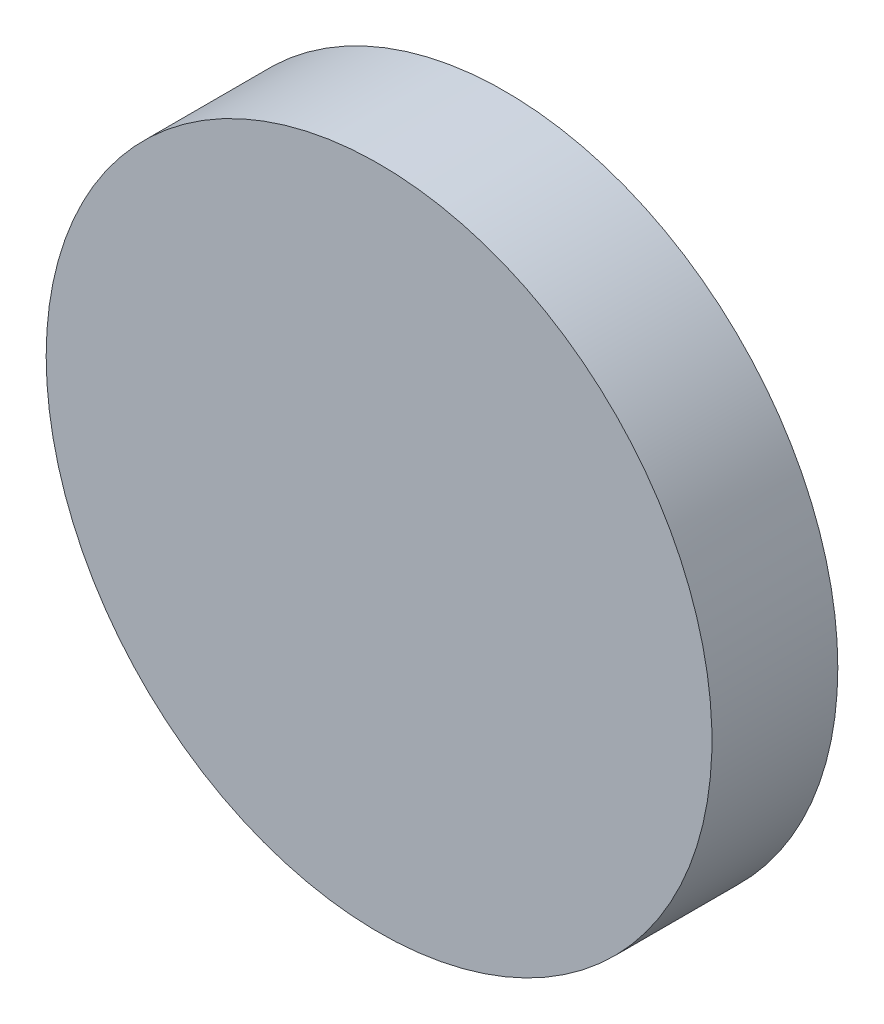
ISO-10303-21;
HEADER;
FILE_DESCRIPTION(('STEP AP214'),'2;1');
FILE_NAME('part.step','',(''),(''),'','','');
FILE_SCHEMA(('AUTOMOTIVE_DESIGN { 1 0 10303 214 1 1 1 1 }'));
ENDSEC;
DATA;
#1=APPLICATION_CONTEXT('core data for automotive mechanical design processes');
#2=APPLICATION_PROTOCOL_DEFINITION('international standard','automotive_design',2000,#1);
#3=PRODUCT_CONTEXT('',#1,'mechanical');
#4=PRODUCT('Part','Part','',(#3));
#5=PRODUCT_RELATED_PRODUCT_CATEGORY('part','',(#4));
#6=PRODUCT_DEFINITION_FORMATION('','',#4);
#7=PRODUCT_DEFINITION_CONTEXT('part definition',#1,'design');
#8=PRODUCT_DEFINITION('design','',#6,#7);
#9=PRODUCT_DEFINITION_SHAPE('','',#8);
#10=(LENGTH_UNIT() NAMED_UNIT(*) SI_UNIT(.MILLI.,.METRE.));
#11=(NAMED_UNIT(*) PLANE_ANGLE_UNIT() SI_UNIT($,.RADIAN.));
#12=(NAMED_UNIT(*) SI_UNIT($,.STERADIAN.) SOLID_ANGLE_UNIT());
#13=UNCERTAINTY_MEASURE_WITH_UNIT(LENGTH_MEASURE(1.E-05),#10,'distance_accuracy_value','');
#14=(GEOMETRIC_REPRESENTATION_CONTEXT(3) GLOBAL_UNCERTAINTY_ASSIGNED_CONTEXT((#13)) GLOBAL_UNIT_ASSIGNED_CONTEXT((#10,
#11,#12)) REPRESENTATION_CONTEXT('',''));
#15=CARTESIAN_POINT('',(0.,0.,0.));
#16=DIRECTION('',(0.,0.,1.));
#17=DIRECTION('',(1.,0.,0.));
#18=AXIS2_PLACEMENT_3D('',#15,#16,#17);
#19=CARTESIAN_POINT('',(-27.1371781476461,33.7022967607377,12.));
#20=DIRECTION('',(0.,0.,-1.));
#21=DIRECTION('',(-1.,0.,0.));
#22=AXIS2_PLACEMENT_3D('',#19,#20,#21);
#23=PLANE('',#22);
#24=CARTESIAN_POINT('',(-27.1371781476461,33.7022967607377,12.));
#25=DIRECTION('',(0.,0.,1.));
#26=DIRECTION('',(0.262310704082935,0.964983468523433,0.));
#27=AXIS2_PLACEMENT_3D('',#24,#25,#26);
#28=CIRCLE('',#27,4.00000000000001);
#29=CARTESIAN_POINT('',(-31.0130246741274,34.6911413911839,12.));
#30=VERTEX_POINT('',#29);
#31=CARTESIAN_POINT('',(-26.0879353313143,37.5622306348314,12.));
#32=VERTEX_POINT('',#31);
#33=EDGE_CURVE('E151',#30,#32,#28,.F.);
#34=ORIENTED_EDGE('',*,*,#33,.T.);
#35=CARTESIAN_POINT('',(-22.6778961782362,50.1070157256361,12.));
#36=DIRECTION('',(0.,0.,-1.));
#37=DIRECTION('',(0.412325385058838,-0.91103664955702,0.));
#38=AXIS2_PLACEMENT_3D('',#35,#36,#37);
#39=CIRCLE('',#38,13.);
#40=CARTESIAN_POINT('',(-17.3176661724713,38.2635392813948,12.));
#41=VERTEX_POINT('',#40);
#42=EDGE_CURVE('E143',#32,#41,#39,.F.);
#43=ORIENTED_EDGE('',*,*,#42,.T.);
#44=CARTESIAN_POINT('',(0.,0.,12.));
#45=DIRECTION('',(0.,0.,1.));
#46=DIRECTION('',(-0.999451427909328,-0.0331186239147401,0.));
#47=AXIS2_PLACEMENT_3D('',#44,#45,#46);
#48=CIRCLE('',#47,42.);
#49=CARTESIAN_POINT('',(-41.9769599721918,-1.39098220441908,12.));
#50=VERTEX_POINT('',#49);
#51=EDGE_CURVE('E147',#41,#50,#48,.F.);
#52=ORIENTED_EDGE('',*,*,#51,.T.);
#53=CARTESIAN_POINT('',(-54.969828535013,-1.8215243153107,12.));
#54=DIRECTION('',(0.,0.,-1.));
#55=DIRECTION('',(0.941403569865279,0.337282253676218,0.));
#56=AXIS2_PLACEMENT_3D('',#53,#54,#55);
#57=CIRCLE('',#56,13.);
#58=CARTESIAN_POINT('',(-42.7315821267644,2.56314498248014,12.));
#59=VERTEX_POINT('',#58);
#60=EDGE_CURVE('E212',#50,#59,#57,.F.);
#61=ORIENTED_EDGE('',*,*,#60,.T.);
#62=DIRECTION('',(-0.337282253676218,0.941403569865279,0.));
#63=VECTOR('',#62,1.);
#64=CARTESIAN_POINT('',(-44.1545751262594,6.53492433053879,12.));
#65=LINE('',#64,#63);
#66=CARTESIAN_POINT('',(-44.1545751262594,6.53492433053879,12.));
#67=VERTEX_POINT('',#66);
#68=EDGE_CURVE('E359',#59,#67,#65,.T.);
#69=ORIENTED_EDGE('',*,*,#68,.T.);
#70=CARTESIAN_POINT('',(-37.5647501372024,8.89590010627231,12.));
#71=DIRECTION('',(0.,0.,1.));
#72=DIRECTION('',(-1.,0.,0.));
#73=AXIS2_PLACEMENT_3D('',#70,#71,#72);
#74=CIRCLE('',#73,7.);
#75=CARTESIAN_POINT('',(-44.5647501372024,8.89590010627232,12.));
#76=VERTEX_POINT('',#75);
#77=EDGE_CURVE('E224',#67,#76,#74,.F.);
#78=ORIENTED_EDGE('',*,*,#77,.T.);
#79=CARTESIAN_POINT('',(-37.5647501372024,8.89590010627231,12.));
#80=DIRECTION('',(0.,0.,1.));
#81=DIRECTION('',(-0.992483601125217,0.122377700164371,0.));
#82=AXIS2_PLACEMENT_3D('',#79,#80,#81);
#83=CIRCLE('',#82,7.);
#84=CARTESIAN_POINT('',(-44.5121353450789,9.75254400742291,12.));
#85=VERTEX_POINT('',#84);
#86=EDGE_CURVE('E235',#76,#85,#83,.F.);
#87=ORIENTED_EDGE('',*,*,#86,.T.);
#88=CARTESIAN_POINT('',(-10.7676929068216,5.59170220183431,12.));
#89=DIRECTION('',(0.,0.,1.));
#90=DIRECTION('',(-0.659221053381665,0.75194920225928,0.));
#91=AXIS2_PLACEMENT_3D('',#88,#89,#90);
#92=CIRCLE('',#91,34.);
#93=CARTESIAN_POINT('',(-33.1812087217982,31.1579750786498,12.));
#94=VERTEX_POINT('',#93);
#95=EDGE_CURVE('E247',#85,#94,#92,.F.);
#96=ORIENTED_EDGE('',*,*,#95,.T.);
#97=CARTESIAN_POINT('',(-37.7957560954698,36.4216194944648,12.));
#98=DIRECTION('',(0.,0.,-1.));
#99=DIRECTION('',(0.968961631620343,-0.247211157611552,0.));
#100=AXIS2_PLACEMENT_3D('',#97,#98,#99);
#101=CIRCLE('',#100,7.);
#102=EDGE_CURVE('E259',#94,#30,#101,.F.);
#103=ORIENTED_EDGE('',*,*,#102,.T.);
#104=EDGE_LOOP('',(#34,#43,#52,#61,#69,#78,#87,#96,#103));
#105=FACE_BOUND('',#104,.T.);
#106=ADVANCED_FACE('F16',(#105),#23,.T.);
#107=CARTESIAN_POINT('',(-22.6778961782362,50.1070157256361,9.));
#108=DIRECTION('',(0.,0.,-1.));
#109=DIRECTION('',(-1.,0.,0.));
#110=AXIS2_PLACEMENT_3D('',#107,#108,#109);
#111=TOROIDAL_SURFACE('',#110,13.,3.);
#112=CARTESIAN_POINT('',(-22.6778961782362,50.1070157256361,9.));
#113=DIRECTION('',(0.,0.,-1.));
#114=DIRECTION('',(-1.,0.,0.));
#115=AXIS2_PLACEMENT_3D('',#112,#113,#114);
#116=CIRCLE('',#115,10.);
#117=CARTESIAN_POINT('',(-18.5546423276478,40.9966492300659,9.));
#118=VERTEX_POINT('',#117);
#119=CARTESIAN_POINT('',(-25.3010032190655,40.4571810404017,9.));
#120=VERTEX_POINT('',#119);
#121=EDGE_CURVE('E161',#118,#120,#116,.T.);
#122=ORIENTED_EDGE('',*,*,#121,.F.);
#123=CARTESIAN_POINT('',(-17.3176661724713,38.2635392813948,9.));
#124=DIRECTION('',(0.911036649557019,0.41232538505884,0.));
#125=DIRECTION('',(-0.41232538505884,0.911036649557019,0.));
#126=AXIS2_PLACEMENT_3D('',#123,#124,#125);
#127=CIRCLE('',#126,3.);
#128=EDGE_CURVE('E159',#118,#41,#127,.T.);
#129=ORIENTED_EDGE('',*,*,#128,.T.);
#130=ORIENTED_EDGE('',*,*,#42,.F.);
#131=CARTESIAN_POINT('',(-26.0879353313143,37.5622306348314,9.));
#132=DIRECTION('',(0.964983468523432,-0.262310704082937,0.));
#133=DIRECTION('',(0.262310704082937,0.964983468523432,0.));
#134=AXIS2_PLACEMENT_3D('',#131,#132,#133);
#135=CIRCLE('',#134,3.);
#136=EDGE_CURVE('E288',#32,#120,#135,.F.);
#137=ORIENTED_EDGE('',*,*,#136,.T.);
#138=EDGE_LOOP('',(#122,#129,#130,#137));
#139=FACE_BOUND('',#138,.T.);
#140=ADVANCED_FACE('F160',(#139),#111,.F.);
#141=CARTESIAN_POINT('',(0.,0.,9.));
#142=DIRECTION('',(0.,0.,-1.));
#143=DIRECTION('',(-1.,0.,0.));
#144=AXIS2_PLACEMENT_3D('',#141,#142,#143);
#145=TOROIDAL_SURFACE('',#144,42.,3.);
#146=CARTESIAN_POINT('',(0.,0.,9.));
#147=DIRECTION('',(0.,0.,-1.));
#148=DIRECTION('',(-1.,0.,0.));
#149=AXIS2_PLACEMENT_3D('',#146,#147,#148);
#150=CIRCLE('',#149,45.);
#151=CARTESIAN_POINT('',(-44.9753142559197,-1.4903380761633,9.));
#152=VERTEX_POINT('',#151);
#153=EDGE_CURVE('E376',#118,#152,#150,.T.);
#154=ORIENTED_EDGE('',*,*,#153,.T.);
#155=CARTESIAN_POINT('',(-41.9769599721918,-1.39098220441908,9.));
#156=DIRECTION('',(0.0331186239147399,-0.999451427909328,0.));
#157=DIRECTION('',(0.999451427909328,0.0331186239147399,0.));
#158=AXIS2_PLACEMENT_3D('',#155,#156,#157);
#159=CIRCLE('',#158,3.);
#160=EDGE_CURVE('E165',#152,#50,#159,.F.);
#161=ORIENTED_EDGE('',*,*,#160,.T.);
#162=ORIENTED_EDGE('',*,*,#51,.F.);
#163=ORIENTED_EDGE('',*,*,#128,.F.);
#164=EDGE_LOOP('',(#154,#161,#162,#163));
#165=FACE_BOUND('',#164,.T.);
#166=ADVANCED_FACE('F168',(#165),#145,.F.);
#167=CARTESIAN_POINT('',(-54.969828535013,-1.8215243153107,9.));
#168=DIRECTION('',(0.,0.,-1.));
#169=DIRECTION('',(-1.,0.,0.));
#170=AXIS2_PLACEMENT_3D('',#167,#168,#169);
#171=TOROIDAL_SURFACE('',#170,13.,3.);
#172=ORIENTED_EDGE('',*,*,#60,.F.);
#173=ORIENTED_EDGE('',*,*,#160,.F.);
#174=CARTESIAN_POINT('',(-54.969828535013,-1.8215243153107,9.));
#175=DIRECTION('',(0.,0.,-1.));
#176=DIRECTION('',(-1.,0.,0.));
#177=AXIS2_PLACEMENT_3D('',#174,#175,#176);
#178=CIRCLE('',#177,9.99999999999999);
#179=CARTESIAN_POINT('',(-45.5557928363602,1.55129822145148,9.));
#180=VERTEX_POINT('',#179);
#181=EDGE_CURVE('E378',#180,#152,#178,.T.);
#182=ORIENTED_EDGE('',*,*,#181,.F.);
#183=CARTESIAN_POINT('',(-42.7315821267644,2.56314498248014,9.));
#184=DIRECTION('',(-0.337282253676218,0.941403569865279,0.));
#185=DIRECTION('',(-0.941403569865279,-0.337282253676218,0.));
#186=AXIS2_PLACEMENT_3D('',#183,#184,#185);
#187=CIRCLE('',#186,3.);
#188=EDGE_CURVE('E367',#180,#59,#187,.T.);
#189=ORIENTED_EDGE('',*,*,#188,.T.);
#190=EDGE_LOOP('',(#172,#173,#182,#189));
#191=FACE_BOUND('',#190,.T.);
#192=ADVANCED_FACE('F189',(#191),#171,.F.);
#193=CARTESIAN_POINT('',(-44.1545751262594,6.53492433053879,9.));
#194=DIRECTION('',(-0.337282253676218,0.941403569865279,0.));
#195=DIRECTION('',(-0.941403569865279,-0.337282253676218,0.));
#196=AXIS2_PLACEMENT_3D('',#193,#194,#195);
#197=CYLINDRICAL_SURFACE('',#196,3.);
#198=ORIENTED_EDGE('',*,*,#68,.F.);
#199=ORIENTED_EDGE('',*,*,#188,.F.);
#200=DIRECTION('',(-0.337282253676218,0.941403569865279,0.));
#201=VECTOR('',#200,1.);
#202=CARTESIAN_POINT('',(-46.9787858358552,5.52307756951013,9.));
#203=LINE('',#202,#201);
#204=CARTESIAN_POINT('',(-46.9787858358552,5.52307756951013,9.));
#205=VERTEX_POINT('',#204);
#206=EDGE_CURVE('E385',#205,#180,#203,.F.);
#207=ORIENTED_EDGE('',*,*,#206,.F.);
#208=CARTESIAN_POINT('',(-44.1545751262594,6.53492433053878,9.));
#209=DIRECTION('',(-0.337282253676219,0.941403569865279,0.));
#210=DIRECTION('',(-0.941403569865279,-0.337282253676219,0.));
#211=AXIS2_PLACEMENT_3D('',#208,#209,#210);
#212=CIRCLE('',#211,3.);
#213=EDGE_CURVE('E366',#205,#67,#212,.T.);
#214=ORIENTED_EDGE('',*,*,#213,.T.);
#215=EDGE_LOOP('',(#198,#199,#207,#214));
#216=FACE_BOUND('',#215,.T.);
#217=ADVANCED_FACE('F481',(#216),#197,.F.);
#218=CARTESIAN_POINT('',(-37.5647501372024,8.89590010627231,9.));
#219=DIRECTION('',(0.,0.,-1.));
#220=DIRECTION('',(-1.,0.,0.));
#221=AXIS2_PLACEMENT_3D('',#218,#219,#220);
#222=TOROIDAL_SURFACE('',#221,7.,3.);
#223=ORIENTED_EDGE('',*,*,#86,.F.);
#224=ORIENTED_EDGE('',*,*,#77,.F.);
#225=ORIENTED_EDGE('',*,*,#213,.F.);
#226=CARTESIAN_POINT('',(-37.5647501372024,8.89590010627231,9.));
#227=DIRECTION('',(0.,0.,-1.));
#228=DIRECTION('',(-1.,0.,0.));
#229=AXIS2_PLACEMENT_3D('',#226,#227,#228);
#230=CIRCLE('',#229,10.);
#231=CARTESIAN_POINT('',(-47.4895861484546,10.119677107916,9.));
#232=VERTEX_POINT('',#231);
#233=EDGE_CURVE('E394',#205,#232,#230,.T.);
#234=ORIENTED_EDGE('',*,*,#233,.T.);
#235=CARTESIAN_POINT('',(-44.512135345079,9.75254400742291,9.));
#236=DIRECTION('',(0.122377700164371,0.992483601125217,0.));
#237=DIRECTION('',(-0.992483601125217,0.122377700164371,0.));
#238=AXIS2_PLACEMENT_3D('',#235,#236,#237);
#239=CIRCLE('',#238,3.);
#240=EDGE_CURVE('E335',#232,#85,#239,.T.);
#241=ORIENTED_EDGE('',*,*,#240,.T.);
#242=EDGE_LOOP('',(#223,#224,#225,#234,#241));
#243=FACE_BOUND('',#242,.T.);
#244=ADVANCED_FACE('F340',(#243),#222,.F.);
#245=CARTESIAN_POINT('',(-10.7676929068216,5.59170220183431,9.));
#246=DIRECTION('',(0.,0.,-1.));
#247=DIRECTION('',(-1.,0.,0.));
#248=AXIS2_PLACEMENT_3D('',#245,#246,#247);
#249=TOROIDAL_SURFACE('',#248,34.,3.);
#250=ORIENTED_EDGE('',*,*,#95,.F.);
#251=ORIENTED_EDGE('',*,*,#240,.F.);
#252=CARTESIAN_POINT('',(-10.7676929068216,5.59170220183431,9.));
#253=DIRECTION('',(0.,0.,-1.));
#254=DIRECTION('',(-1.,0.,0.));
#255=AXIS2_PLACEMENT_3D('',#252,#253,#254);
#256=CIRCLE('',#255,37.);
#257=CARTESIAN_POINT('',(-35.1588718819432,33.4138226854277,9.));
#258=VERTEX_POINT('',#257);
#259=EDGE_CURVE('E326',#232,#258,#256,.T.);
#260=ORIENTED_EDGE('',*,*,#259,.T.);
#261=CARTESIAN_POINT('',(-33.1812087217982,31.1579750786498,9.));
#262=DIRECTION('',(-0.75194920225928,-0.659221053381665,0.));
#263=DIRECTION('',(0.659221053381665,-0.75194920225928,0.));
#264=AXIS2_PLACEMENT_3D('',#261,#262,#263);
#265=CIRCLE('',#264,3.);
#266=EDGE_CURVE('E278',#258,#94,#265,.F.);
#267=ORIENTED_EDGE('',*,*,#266,.T.);
#268=EDGE_LOOP('',(#250,#251,#260,#267));
#269=FACE_BOUND('',#268,.T.);
#270=ADVANCED_FACE('F337',(#269),#249,.F.);
#271=CARTESIAN_POINT('',(-37.7957560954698,36.4216194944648,9.));
#272=DIRECTION('',(0.,0.,-1.));
#273=DIRECTION('',(-1.,0.,0.));
#274=AXIS2_PLACEMENT_3D('',#271,#272,#273);
#275=TOROIDAL_SURFACE('',#274,7.,3.);
#276=ORIENTED_EDGE('',*,*,#102,.F.);
#277=ORIENTED_EDGE('',*,*,#266,.F.);
#278=CARTESIAN_POINT('',(-37.7957560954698,36.4216194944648,9.));
#279=DIRECTION('',(0.,0.,-1.));
#280=DIRECTION('',(-1.,0.,0.));
#281=AXIS2_PLACEMENT_3D('',#278,#279,#280);
#282=CIRCLE('',#281,4.);
#283=CARTESIAN_POINT('',(-33.9199095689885,35.4327748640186,9.));
#284=VERTEX_POINT('',#283);
#285=EDGE_CURVE('E283',#284,#258,#282,.T.);
#286=ORIENTED_EDGE('',*,*,#285,.F.);
#287=CARTESIAN_POINT('',(-31.0130246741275,34.6911413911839,9.));
#288=DIRECTION('',(0.247211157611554,0.968961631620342,0.));
#289=DIRECTION('',(-0.968961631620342,0.247211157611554,0.));
#290=AXIS2_PLACEMENT_3D('',#287,#288,#289);
#291=CIRCLE('',#290,3.);
#292=EDGE_CURVE('E280',#284,#30,#291,.T.);
#293=ORIENTED_EDGE('',*,*,#292,.T.);
#294=EDGE_LOOP('',(#276,#277,#286,#293));
#295=FACE_BOUND('',#294,.T.);
#296=ADVANCED_FACE('F281',(#295),#275,.F.);
#297=CARTESIAN_POINT('',(-27.1371781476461,33.7022967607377,9.));
#298=DIRECTION('',(0.,0.,-1.));
#299=DIRECTION('',(-1.,0.,0.));
#300=AXIS2_PLACEMENT_3D('',#297,#298,#299);
#301=TOROIDAL_SURFACE('',#300,4.00000000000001,3.);
#302=CARTESIAN_POINT('',(-27.1371781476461,33.7022967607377,9.));
#303=DIRECTION('',(0.,0.,-1.));
#304=DIRECTION('',(-1.,0.,0.));
#305=AXIS2_PLACEMENT_3D('',#302,#303,#304);
#306=CIRCLE('',#305,7.00000000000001);
#307=EDGE_CURVE('E317',#284,#120,#306,.T.);
#308=ORIENTED_EDGE('',*,*,#307,.T.);
#309=ORIENTED_EDGE('',*,*,#136,.F.);
#310=ORIENTED_EDGE('',*,*,#33,.F.);
#311=ORIENTED_EDGE('',*,*,#292,.F.);
#312=EDGE_LOOP('',(#308,#309,#310,#311));
#313=FACE_BOUND('',#312,.T.);
#314=ADVANCED_FACE('F291',(#313),#301,.F.);
#315=CARTESIAN_POINT('',(-22.6778961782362,50.1070157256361,12.));
#316=DIRECTION('',(0.,0.,-1.));
#317=DIRECTION('',(-1.,0.,0.));
#318=AXIS2_PLACEMENT_3D('',#315,#316,#317);
#319=CYLINDRICAL_SURFACE('',#318,10.);
#320=DIRECTION('',(0.,0.,-1.));
#321=VECTOR('',#320,1.);
#322=CARTESIAN_POINT('',(-25.3010032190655,40.4571810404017,12.));
#323=LINE('',#322,#321);
#324=CARTESIAN_POINT('',(-25.3010032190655,40.4571810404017,1.00000000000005));
#325=VERTEX_POINT('',#324);
#326=EDGE_CURVE('E72',#120,#325,#323,.T.);
#327=ORIENTED_EDGE('',*,*,#326,.T.);
#328=CARTESIAN_POINT('',(-22.6778961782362,50.1070157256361,1.00000000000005));
#329=DIRECTION('',(0.,0.,1.));
#330=DIRECTION('',(1.,0.,0.));
#331=AXIS2_PLACEMENT_3D('',#328,#329,#330);
#332=CIRCLE('',#331,10.);
#333=CARTESIAN_POINT('',(-18.5546423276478,40.9966492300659,1.00000000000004));
#334=VERTEX_POINT('',#333);
#335=EDGE_CURVE('E429',#334,#325,#332,.F.);
#336=ORIENTED_EDGE('',*,*,#335,.F.);
#337=DIRECTION('',(0.,0.,-1.));
#338=VECTOR('',#337,1.);
#339=CARTESIAN_POINT('',(-18.5546423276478,40.9966492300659,12.));
#340=LINE('',#339,#338);
#341=EDGE_CURVE('E379',#334,#118,#340,.F.);
#342=ORIENTED_EDGE('',*,*,#341,.T.);
#343=ORIENTED_EDGE('',*,*,#121,.T.);
#344=EDGE_LOOP('',(#327,#336,#342,#343));
#345=FACE_BOUND('',#344,.T.);
#346=ADVANCED_FACE('F309',(#345),#319,.T.);
#347=CARTESIAN_POINT('',(0.,0.,12.));
#348=DIRECTION('',(0.,0.,-1.));
#349=DIRECTION('',(-1.,0.,0.));
#350=AXIS2_PLACEMENT_3D('',#347,#348,#349);
#351=CYLINDRICAL_SURFACE('',#350,45.);
#352=ORIENTED_EDGE('',*,*,#153,.F.);
#353=ORIENTED_EDGE('',*,*,#341,.F.);
#354=CARTESIAN_POINT('',(0.,0.,1.00000000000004));
#355=DIRECTION('',(0.,0.,-1.));
#356=DIRECTION('',(-1.,0.,0.));
#357=AXIS2_PLACEMENT_3D('',#354,#355,#356);
#358=CIRCLE('',#357,45.);
#359=CARTESIAN_POINT('',(-44.9753142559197,-1.4903380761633,1.00000000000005));
#360=VERTEX_POINT('',#359);
#361=EDGE_CURVE('E418',#334,#360,#358,.T.);
#362=ORIENTED_EDGE('',*,*,#361,.T.);
#363=DIRECTION('',(0.,0.,-1.));
#364=VECTOR('',#363,1.);
#365=CARTESIAN_POINT('',(-44.9753142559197,-1.4903380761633,12.));
#366=LINE('',#365,#364);
#367=EDGE_CURVE('E384',#152,#360,#366,.T.);
#368=ORIENTED_EDGE('',*,*,#367,.F.);
#369=EDGE_LOOP('',(#352,#353,#362,#368));
#370=FACE_BOUND('',#369,.T.);
#371=ADVANCED_FACE('F468',(#370),#351,.F.);
#372=CARTESIAN_POINT('',(-54.969828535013,-1.8215243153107,12.));
#373=DIRECTION('',(0.,0.,-1.));
#374=DIRECTION('',(-1.,0.,0.));
#375=AXIS2_PLACEMENT_3D('',#372,#373,#374);
#376=CYLINDRICAL_SURFACE('',#375,9.99999999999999);
#377=ORIENTED_EDGE('',*,*,#367,.T.);
#378=CARTESIAN_POINT('',(-54.969828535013,-1.8215243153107,1.00000000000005));
#379=DIRECTION('',(0.,0.,1.));
#380=DIRECTION('',(1.,0.,0.));
#381=AXIS2_PLACEMENT_3D('',#378,#379,#380);
#382=CIRCLE('',#381,10.);
#383=CARTESIAN_POINT('',(-45.5557928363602,1.55129822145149,1.00000000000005));
#384=VERTEX_POINT('',#383);
#385=EDGE_CURVE('E414',#384,#360,#382,.F.);
#386=ORIENTED_EDGE('',*,*,#385,.F.);
#387=DIRECTION('',(0.,0.,1.));
#388=VECTOR('',#387,1.);
#389=CARTESIAN_POINT('',(-45.5557928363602,1.55129822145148,12.));
#390=LINE('',#389,#388);
#391=EDGE_CURVE('E388',#180,#384,#390,.F.);
#392=ORIENTED_EDGE('',*,*,#391,.F.);
#393=ORIENTED_EDGE('',*,*,#181,.T.);
#394=EDGE_LOOP('',(#377,#386,#392,#393));
#395=FACE_BOUND('',#394,.T.);
#396=ADVANCED_FACE('F478',(#395),#376,.T.);
#397=CARTESIAN_POINT('',(-46.9787858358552,5.52307756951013,12.));
#398=DIRECTION('',(0.941403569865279,0.337282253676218,0.));
#399=DIRECTION('',(-0.337282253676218,0.941403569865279,0.));
#400=AXIS2_PLACEMENT_3D('',#397,#398,#399);
#401=PLANE('',#400);
#402=ORIENTED_EDGE('',*,*,#391,.T.);
#403=DIRECTION('',(0.337282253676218,-0.941403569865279,0.));
#404=VECTOR('',#403,1.);
#405=CARTESIAN_POINT('',(-46.9787858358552,5.52307756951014,1.00000000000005));
#406=LINE('',#405,#404);
#407=CARTESIAN_POINT('',(-46.9787858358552,5.52307756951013,1.00000000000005));
#408=VERTEX_POINT('',#407);
#409=EDGE_CURVE('E409',#408,#384,#406,.T.);
#410=ORIENTED_EDGE('',*,*,#409,.F.);
#411=DIRECTION('',(0.,0.,-1.));
#412=VECTOR('',#411,1.);
#413=CARTESIAN_POINT('',(-46.9787858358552,5.52307756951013,12.));
#414=LINE('',#413,#412);
#415=EDGE_CURVE('E395',#408,#205,#414,.F.);
#416=ORIENTED_EDGE('',*,*,#415,.T.);
#417=ORIENTED_EDGE('',*,*,#206,.T.);
#418=EDGE_LOOP('',(#402,#410,#416,#417));
#419=FACE_BOUND('',#418,.T.);
#420=ADVANCED_FACE('F537',(#419),#401,.T.);
#421=CARTESIAN_POINT('',(-37.5647501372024,8.89590010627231,12.));
#422=DIRECTION('',(0.,0.,-1.));
#423=DIRECTION('',(-1.,0.,0.));
#424=AXIS2_PLACEMENT_3D('',#421,#422,#423);
#425=CYLINDRICAL_SURFACE('',#424,10.);
#426=ORIENTED_EDGE('',*,*,#233,.F.);
#427=ORIENTED_EDGE('',*,*,#415,.F.);
#428=CARTESIAN_POINT('',(-37.5647501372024,8.89590010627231,1.00000000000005));
#429=DIRECTION('',(0.,0.,-1.));
#430=DIRECTION('',(-1.,0.,0.));
#431=AXIS2_PLACEMENT_3D('',#428,#429,#430);
#432=CIRCLE('',#431,10.);
#433=CARTESIAN_POINT('',(-47.4895861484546,10.119677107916,1.00000000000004));
#434=VERTEX_POINT('',#433);
#435=EDGE_CURVE('E443',#408,#434,#432,.T.);
#436=ORIENTED_EDGE('',*,*,#435,.T.);
#437=DIRECTION('',(0.,0.,-1.));
#438=VECTOR('',#437,1.);
#439=CARTESIAN_POINT('',(-47.4895861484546,10.119677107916,12.));
#440=LINE('',#439,#438);
#441=EDGE_CURVE('E327',#434,#232,#440,.F.);
#442=ORIENTED_EDGE('',*,*,#441,.T.);
#443=EDGE_LOOP('',(#426,#427,#436,#442));
#444=FACE_BOUND('',#443,.T.);
#445=ADVANCED_FACE('F539',(#444),#425,.F.);
#446=CARTESIAN_POINT('',(-10.7676929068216,5.59170220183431,12.));
#447=DIRECTION('',(0.,0.,-1.));
#448=DIRECTION('',(-1.,0.,0.));
#449=AXIS2_PLACEMENT_3D('',#446,#447,#448);
#450=CYLINDRICAL_SURFACE('',#449,37.);
#451=ORIENTED_EDGE('',*,*,#259,.F.);
#452=ORIENTED_EDGE('',*,*,#441,.F.);
#453=CARTESIAN_POINT('',(-10.7676929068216,5.59170220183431,1.00000000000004));
#454=DIRECTION('',(0.,0.,-1.));
#455=DIRECTION('',(-1.,0.,0.));
#456=AXIS2_PLACEMENT_3D('',#453,#454,#455);
#457=CIRCLE('',#456,37.);
#458=CARTESIAN_POINT('',(-35.1588718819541,33.4138226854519,1.00000000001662));
#459=VERTEX_POINT('',#458);
#460=EDGE_CURVE('E441',#434,#459,#457,.T.);
#461=ORIENTED_EDGE('',*,*,#460,.T.);
#462=DIRECTION('',(0.,0.,-1.));
#463=VECTOR('',#462,1.);
#464=CARTESIAN_POINT('',(-35.1588718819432,33.4138226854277,12.));
#465=LINE('',#464,#463);
#466=EDGE_CURVE('E325',#258,#459,#465,.T.);
#467=ORIENTED_EDGE('',*,*,#466,.F.);
#468=EDGE_LOOP('',(#451,#452,#461,#467));
#469=FACE_BOUND('',#468,.T.);
#470=ADVANCED_FACE('F529',(#469),#450,.F.);
#471=CARTESIAN_POINT('',(-37.7957560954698,36.4216194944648,12.));
#472=DIRECTION('',(0.,0.,-1.));
#473=DIRECTION('',(-1.,0.,0.));
#474=AXIS2_PLACEMENT_3D('',#471,#472,#473);
#475=CYLINDRICAL_SURFACE('',#474,4.);
#476=ORIENTED_EDGE('',*,*,#466,.T.);
#477=CARTESIAN_POINT('',(-37.7957560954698,36.4216194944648,1.0000000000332));
#478=DIRECTION('',(0.,0.,1.));
#479=DIRECTION('',(1.,0.,0.));
#480=AXIS2_PLACEMENT_3D('',#477,#478,#479);
#481=CIRCLE('',#480,3.99999999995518);
#482=CARTESIAN_POINT('',(-33.9199095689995,35.4327748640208,1.00000000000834));
#483=VERTEX_POINT('',#482);
#484=EDGE_CURVE('E436',#483,#459,#481,.F.);
#485=ORIENTED_EDGE('',*,*,#484,.F.);
#486=DIRECTION('',(0.,0.,-1.));
#487=VECTOR('',#486,1.);
#488=CARTESIAN_POINT('',(-33.9199095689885,35.4327748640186,12.));
#489=LINE('',#488,#487);
#490=EDGE_CURVE('E432',#483,#284,#489,.F.);
#491=ORIENTED_EDGE('',*,*,#490,.T.);
#492=ORIENTED_EDGE('',*,*,#285,.T.);
#493=EDGE_LOOP('',(#476,#485,#491,#492));
#494=FACE_BOUND('',#493,.T.);
#495=ADVANCED_FACE('F525',(#494),#475,.T.);
#496=CARTESIAN_POINT('',(-27.1371781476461,33.7022967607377,12.));
#497=DIRECTION('',(0.,0.,-1.));
#498=DIRECTION('',(-1.,0.,0.));
#499=AXIS2_PLACEMENT_3D('',#496,#497,#498);
#500=CYLINDRICAL_SURFACE('',#499,7.00000000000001);
#501=ORIENTED_EDGE('',*,*,#307,.F.);
#502=ORIENTED_EDGE('',*,*,#490,.F.);
#503=CARTESIAN_POINT('',(-27.1371781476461,33.7022967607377,1.00000000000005));
#504=DIRECTION('',(0.,0.,-1.));
#505=DIRECTION('',(-1.,0.,0.));
#506=AXIS2_PLACEMENT_3D('',#503,#504,#505);
#507=CIRCLE('',#506,7.00000000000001);
#508=EDGE_CURVE('E428',#483,#325,#507,.T.);
#509=ORIENTED_EDGE('',*,*,#508,.T.);
#510=ORIENTED_EDGE('',*,*,#326,.F.);
#511=EDGE_LOOP('',(#501,#502,#509,#510));
#512=FACE_BOUND('',#511,.T.);
#513=ADVANCED_FACE('F425',(#512),#500,.F.);
#514=CARTESIAN_POINT('',(-22.6778961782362,50.1070157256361,1.00000000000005));
#515=DIRECTION('',(0.,0.,1.));
#516=DIRECTION('',(1.,0.,0.));
#517=AXIS2_PLACEMENT_3D('',#514,#515,#516);
#518=CONICAL_SURFACE('',#517,10.,0.523598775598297);
#519=DIRECTION('',(-0.131155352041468,-0.482491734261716,0.866025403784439));
#520=VECTOR('',#519,1.);
#521=CARTESIAN_POINT('',(-25.1495580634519,41.0143145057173,0.));
#522=LINE('',#521,#520);
#523=CARTESIAN_POINT('',(-25.1495580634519,41.0143145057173,0.));
#524=VERTEX_POINT('',#523);
#525=EDGE_CURVE('E63',#325,#524,#522,.F.);
#526=ORIENTED_EDGE('',*,*,#525,.T.);
#527=CARTESIAN_POINT('',(-22.6778961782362,50.1070157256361,0.));
#528=DIRECTION('',(0.,0.,1.));
#529=DIRECTION('',(1.,0.,0.));
#530=AXIS2_PLACEMENT_3D('',#527,#528,#529);
#531=CIRCLE('',#530,9.42264973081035);
#532=CARTESIAN_POINT('',(-18.7926984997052,41.5226364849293,0.));
#533=VERTEX_POINT('',#532);
#534=EDGE_CURVE('E463',#524,#533,#531,.T.);
#535=ORIENTED_EDGE('',*,*,#534,.T.);
#536=DIRECTION('',(0.20616269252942,-0.455518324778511,0.866025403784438));
#537=VECTOR('',#536,1.);
#538=CARTESIAN_POINT('',(-18.7926984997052,41.5226364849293,0.));
#539=LINE('',#538,#537);
#540=EDGE_CURVE('E420',#533,#334,#539,.T.);
#541=ORIENTED_EDGE('',*,*,#540,.T.);
#542=ORIENTED_EDGE('',*,*,#335,.T.);
#543=EDGE_LOOP('',(#526,#535,#541,#542));
#544=FACE_BOUND('',#543,.T.);
#545=ADVANCED_FACE('F461',(#544),#518,.T.);
#546=CARTESIAN_POINT('',(0.,0.,0.));
#547=DIRECTION('',(0.,0.,-1.));
#548=DIRECTION('',(-1.,0.,0.));
#549=AXIS2_PLACEMENT_3D('',#546,#547,#548);
#550=CONICAL_SURFACE('',#549,45.5773502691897,0.523598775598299);
#551=ORIENTED_EDGE('',*,*,#361,.F.);
#552=ORIENTED_EDGE('',*,*,#540,.F.);
#553=CARTESIAN_POINT('',(0.,0.,0.));
#554=DIRECTION('',(0.,0.,-1.));
#555=DIRECTION('',(-1.,0.,0.));
#556=AXIS2_PLACEMENT_3D('',#553,#554,#555);
#557=CIRCLE('',#556,45.5773502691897);
#558=CARTESIAN_POINT('',(-45.5523478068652,-1.50945912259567,0.));
#559=VERTEX_POINT('',#558);
#560=EDGE_CURVE('E471',#533,#559,#557,.T.);
#561=ORIENTED_EDGE('',*,*,#560,.T.);
#562=DIRECTION('',(-0.499725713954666,-0.01655931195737,-0.866025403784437));
#563=VECTOR('',#562,1.);
#564=CARTESIAN_POINT('',(-45.5523478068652,-1.50945912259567,0.));
#565=LINE('',#564,#563);
#566=EDGE_CURVE('E417',#360,#559,#565,.T.);
#567=ORIENTED_EDGE('',*,*,#566,.F.);
#568=EDGE_LOOP('',(#551,#552,#561,#567));
#569=FACE_BOUND('',#568,.T.);
#570=ADVANCED_FACE('F470',(#569),#550,.F.);
#571=CARTESIAN_POINT('',(-54.969828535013,-1.8215243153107,1.00000000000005));
#572=DIRECTION('',(0.,0.,1.));
#573=DIRECTION('',(1.,0.,0.));
#574=AXIS2_PLACEMENT_3D('',#571,#572,#573);
#575=CONICAL_SURFACE('',#574,10.,0.523598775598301);
#576=ORIENTED_EDGE('',*,*,#566,.T.);
#577=CARTESIAN_POINT('',(-54.969828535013,-1.8215243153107,0.));
#578=DIRECTION('',(0.,0.,1.));
#579=DIRECTION('',(1.,0.,0.));
#580=AXIS2_PLACEMENT_3D('',#577,#578,#579);
#581=CIRCLE('',#580,9.42264973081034);
#582=CARTESIAN_POINT('',(-46.099312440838,1.35656822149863,0.));
#583=VERTEX_POINT('',#582);
#584=EDGE_CURVE('E485',#559,#583,#581,.T.);
#585=ORIENTED_EDGE('',*,*,#584,.T.);
#586=DIRECTION('',(-0.470701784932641,-0.168641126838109,-0.866025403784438));
#587=VECTOR('',#586,1.);
#588=CARTESIAN_POINT('',(-45.5557928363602,1.55129822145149,1.00000000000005));
#589=LINE('',#588,#587);
#590=EDGE_CURVE('E412',#384,#583,#589,.T.);
#591=ORIENTED_EDGE('',*,*,#590,.F.);
#592=ORIENTED_EDGE('',*,*,#385,.T.);
#593=EDGE_LOOP('',(#576,#585,#591,#592));
#594=FACE_BOUND('',#593,.T.);
#595=ADVANCED_FACE('F475',(#594),#575,.T.);
#596=CARTESIAN_POINT('',(-40.4243502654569,-14.4830722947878,0.));
#597=DIRECTION('',(0.81527940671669,0.292094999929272,-0.500000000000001));
#598=DIRECTION('',(-0.522799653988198,0.,-0.852455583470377));
#599=AXIS2_PLACEMENT_3D('',#596,#597,#598);
#600=PLANE('',#599);
#601=DIRECTION('',(0.470701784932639,0.168641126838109,0.866025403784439));
#602=VECTOR('',#601,1.);
#603=CARTESIAN_POINT('',(-47.522305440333,5.32834756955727,0.));
#604=LINE('',#603,#602);
#605=CARTESIAN_POINT('',(-47.522305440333,5.32834756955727,0.));
#606=VERTEX_POINT('',#605);
#607=EDGE_CURVE('E411',#606,#408,#604,.T.);
#608=ORIENTED_EDGE('',*,*,#607,.T.);
#609=ORIENTED_EDGE('',*,*,#409,.T.);
#610=ORIENTED_EDGE('',*,*,#590,.T.);
#611=DIRECTION('',(-0.337282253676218,0.941403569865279,0.));
#612=VECTOR('',#611,1.);
#613=CARTESIAN_POINT('',(-46.099312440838,1.35656822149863,0.));
#614=LINE('',#613,#612);
#615=EDGE_CURVE('E487',#583,#606,#614,.T.);
#616=ORIENTED_EDGE('',*,*,#615,.T.);
#617=EDGE_LOOP('',(#608,#609,#610,#616));
#618=FACE_BOUND('',#617,.T.);
#619=ADVANCED_FACE('F536',(#618),#600,.T.);
#620=CARTESIAN_POINT('',(-37.5647501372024,8.89590010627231,0.));
#621=DIRECTION('',(0.,0.,-1.));
#622=DIRECTION('',(-1.,0.,0.));
#623=AXIS2_PLACEMENT_3D('',#620,#621,#622);
#624=CONICAL_SURFACE('',#623,10.5773502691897,0.523598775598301);
#625=ORIENTED_EDGE('',*,*,#435,.F.);
#626=ORIENTED_EDGE('',*,*,#607,.F.);
#627=CARTESIAN_POINT('',(-37.5647501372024,8.89590010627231,0.));
#628=DIRECTION('',(0.,0.,-1.));
#629=DIRECTION('',(-1.,0.,0.));
#630=AXIS2_PLACEMENT_3D('',#627,#628,#629);
#631=CIRCLE('',#630,10.5773502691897);
#632=CARTESIAN_POINT('',(-48.0625968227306,10.1903319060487,0.));
#633=VERTEX_POINT('',#632);
#634=EDGE_CURVE('E488',#606,#633,#631,.T.);
#635=ORIENTED_EDGE('',*,*,#634,.T.);
#636=DIRECTION('',(0.49624180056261,-0.0611888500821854,0.866025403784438));
#637=VECTOR('',#636,1.);
#638=CARTESIAN_POINT('',(-48.0625968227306,10.1903319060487,0.));
#639=LINE('',#638,#637);
#640=EDGE_CURVE('E440',#633,#434,#639,.T.);
#641=ORIENTED_EDGE('',*,*,#640,.T.);
#642=EDGE_LOOP('',(#625,#626,#635,#641));
#643=FACE_BOUND('',#642,.T.);
#644=ADVANCED_FACE('F534',(#643),#624,.F.);
#645=CARTESIAN_POINT('',(-10.7676929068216,5.59170220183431,0.));
#646=DIRECTION('',(0.,0.,-1.));
#647=DIRECTION('',(-1.,0.,0.));
#648=AXIS2_PLACEMENT_3D('',#645,#646,#647);
#649=CONICAL_SURFACE('',#648,37.5773502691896,0.523598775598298);
#650=CARTESIAN_POINT('',(-10.7676929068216,5.59170220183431,0.));
#651=DIRECTION('',(0.,0.,-1.));
#652=DIRECTION('',(-1.,0.,0.));
#653=AXIS2_PLACEMENT_3D('',#650,#651,#652);
#654=CIRCLE('',#653,37.5773502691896);
#655=CARTESIAN_POINT('',(-35.5394733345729,33.8479607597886,5.44707955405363E-11));
#656=VERTEX_POINT('',#655);
#657=EDGE_CURVE('E490',#633,#656,#654,.T.);
#658=ORIENTED_EDGE('',*,*,#657,.T.);
#659=DIRECTION('',(-0.329610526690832,0.375974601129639,-0.866025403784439));
#660=VECTOR('',#659,1.);
#661=CARTESIAN_POINT('',(189884.585386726,-216601.051135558,499000.));
#662=LINE('',#661,#660);
#663=EDGE_CURVE('E439',#459,#656,#662,.T.);
#664=ORIENTED_EDGE('',*,*,#663,.F.);
#665=ORIENTED_EDGE('',*,*,#460,.F.);
#666=ORIENTED_EDGE('',*,*,#640,.F.);
#667=EDGE_LOOP('',(#658,#664,#665,#666));
#668=FACE_BOUND('',#667,.T.);
#669=ADVANCED_FACE('F532',(#668),#649,.F.);
#670=CARTESIAN_POINT('',(-37.7957560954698,36.4216194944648,1.0000000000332));
#671=DIRECTION('',(0.,0.,1.));
#672=DIRECTION('',(1.,0.,0.));
#673=AXIS2_PLACEMENT_3D('',#670,#671,#672);
#674=CONICAL_SURFACE('',#673,3.99999999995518,0.523598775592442);
#675=ORIENTED_EDGE('',*,*,#663,.T.);
#676=CARTESIAN_POINT('',(-37.7957560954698,36.4216194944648,5.6843418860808E-11));
#677=DIRECTION('',(0.,0.,1.));
#678=DIRECTION('',(1.,0.,0.));
#679=AXIS2_PLACEMENT_3D('',#676,#677,#678);
#680=CIRCLE('',#679,3.42264973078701);
#681=CARTESIAN_POINT('',(-34.479339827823,35.5755022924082,2.8419974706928E-11));
#682=VERTEX_POINT('',#681);
#683=EDGE_CURVE('E37',#656,#682,#680,.T.);
#684=ORIENTED_EDGE('',*,*,#683,.T.);
#685=DIRECTION('',(0.484480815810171,-0.123605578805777,0.866025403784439));
#686=VECTOR('',#685,1.);
#687=CARTESIAN_POINT('',(-34.4793398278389,35.5755022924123,0.));
#688=LINE('',#687,#686);
#689=EDGE_CURVE('E513',#682,#483,#688,.T.);
#690=ORIENTED_EDGE('',*,*,#689,.T.);
#691=ORIENTED_EDGE('',*,*,#484,.T.);
#692=EDGE_LOOP('',(#675,#684,#690,#691));
#693=FACE_BOUND('',#692,.T.);
#694=ADVANCED_FACE('F515',(#693),#674,.T.);
#695=CARTESIAN_POINT('',(-27.1371781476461,33.7022967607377,0.));
#696=DIRECTION('',(0.,0.,-1.));
#697=DIRECTION('',(-1.,0.,0.));
#698=AXIS2_PLACEMENT_3D('',#695,#696,#697);
#699=CONICAL_SURFACE('',#698,7.57735026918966,0.523598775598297);
#700=ORIENTED_EDGE('',*,*,#508,.F.);
#701=ORIENTED_EDGE('',*,*,#689,.F.);
#702=CARTESIAN_POINT('',(-27.1371781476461,33.7022967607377,0.));
#703=DIRECTION('',(0.,0.,-1.));
#704=DIRECTION('',(-1.,0.,0.));
#705=AXIS2_PLACEMENT_3D('',#702,#703,#704);
#706=CIRCLE('',#705,7.57735026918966);
#707=EDGE_CURVE('E493',#682,#524,#706,.T.);
#708=ORIENTED_EDGE('',*,*,#707,.T.);
#709=ORIENTED_EDGE('',*,*,#525,.F.);
#710=EDGE_LOOP('',(#700,#701,#708,#709));
#711=FACE_BOUND('',#710,.T.);
#712=ADVANCED_FACE('F523',(#711),#699,.F.);
#713=CARTESIAN_POINT('',(0.,0.,0.));
#714=DIRECTION('',(0.,0.,1.));
#715=DIRECTION('',(1.,0.,0.));
#716=AXIS2_PLACEMENT_3D('',#713,#714,#715);
#717=PLANE('',#716);
#718=CARTESIAN_POINT('',(0.,0.,0.));
#719=DIRECTION('',(0.,0.,1.));
#720=DIRECTION('',(1.,0.,0.));
#721=AXIS2_PLACEMENT_3D('',#718,#719,#720);
#722=CIRCLE('',#721,56.);
#723=CARTESIAN_POINT('',(56.,0.,0.));
#724=VERTEX_POINT('',#723);
#725=EDGE_CURVE('E495',#724,#724,#722,.T.);
#726=ORIENTED_EDGE('',*,*,#725,.F.);
#727=EDGE_LOOP('',(#726));
#728=FACE_BOUND('',#727,.T.);
#729=ORIENTED_EDGE('',*,*,#683,.F.);
#730=ORIENTED_EDGE('',*,*,#657,.F.);
#731=ORIENTED_EDGE('',*,*,#634,.F.);
#732=ORIENTED_EDGE('',*,*,#615,.F.);
#733=ORIENTED_EDGE('',*,*,#584,.F.);
#734=ORIENTED_EDGE('',*,*,#560,.F.);
#735=ORIENTED_EDGE('',*,*,#534,.F.);
#736=ORIENTED_EDGE('',*,*,#707,.F.);
#737=EDGE_LOOP('',(#729,#730,#731,#732,#733,#734,#735,#736));
#738=FACE_BOUND('',#737,.T.);
#739=ADVANCED_FACE('F521',(#728,#738),#717,.F.);
#740=CARTESIAN_POINT('',(0.,0.,2.30940107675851));
#741=DIRECTION('',(0.,0.,1.));
#742=DIRECTION('',(1.,0.,0.));
#743=AXIS2_PLACEMENT_3D('',#740,#741,#742);
#744=CONICAL_SURFACE('',#743,60.,1.0471975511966);
#745=CARTESIAN_POINT('',(0.,0.,2.30940107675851));
#746=DIRECTION('',(0.,0.,-1.));
#747=DIRECTION('',(-1.,0.,0.));
#748=AXIS2_PLACEMENT_3D('',#745,#746,#747);
#749=CIRCLE('',#748,60.);
#750=CARTESIAN_POINT('',(-60.,0.,2.30940107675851));
#751=VERTEX_POINT('',#750);
#752=EDGE_CURVE('E28',#751,#751,#749,.F.);
#753=ORIENTED_EDGE('',*,*,#752,.F.);
#754=EDGE_LOOP('',(#753));
#755=FACE_BOUND('',#754,.T.);
#756=ORIENTED_EDGE('',*,*,#725,.T.);
#757=EDGE_LOOP('',(#756));
#758=FACE_BOUND('',#757,.T.);
#759=ADVANCED_FACE('F558',(#755,#758),#744,.T.);
#760=CARTESIAN_POINT('',(0.,0.,25.));
#761=DIRECTION('',(0.,0.,-1.));
#762=DIRECTION('',(-1.,0.,0.));
#763=AXIS2_PLACEMENT_3D('',#760,#761,#762);
#764=CYLINDRICAL_SURFACE('',#763,60.);
#765=ORIENTED_EDGE('',*,*,#752,.T.);
#766=EDGE_LOOP('',(#765));
#767=FACE_BOUND('',#766,.T.);
#768=CARTESIAN_POINT('',(0.,0.,25.));
#769=DIRECTION('',(0.,0.,-1.));
#770=DIRECTION('',(-1.,0.,0.));
#771=AXIS2_PLACEMENT_3D('',#768,#769,#770);
#772=CIRCLE('',#771,60.);
#773=CARTESIAN_POINT('',(-60.,0.,25.));
#774=VERTEX_POINT('',#773);
#775=EDGE_CURVE('E11',#774,#774,#772,.F.);
#776=ORIENTED_EDGE('',*,*,#775,.F.);
#777=EDGE_LOOP('',(#776));
#778=FACE_BOUND('',#777,.T.);
#779=ADVANCED_FACE('F551',(#767,#778),#764,.T.);
#780=CARTESIAN_POINT('',(0.,0.,25.));
#781=DIRECTION('',(0.,0.,1.));
#782=DIRECTION('',(1.,0.,0.));
#783=AXIS2_PLACEMENT_3D('',#780,#781,#782);
#784=PLANE('',#783);
#785=ORIENTED_EDGE('',*,*,#775,.T.);
#786=EDGE_LOOP('',(#785));
#787=FACE_BOUND('',#786,.T.);
#788=ADVANCED_FACE('F549',(#787),#784,.T.);
#789=CLOSED_SHELL('',(#106,#140,#166,#192,#217,#244,#270,#296,#314,#346,#371,#396,#420,#445,
#470,#495,#513,#545,#570,#595,#619,#644,#669,#694,#712,#739,#759,#779,#788));
#790=MANIFOLD_SOLID_BREP('B1',#789);
#791=ADVANCED_BREP_SHAPE_REPRESENTATION('',(#18,#790),#14);
#792=SHAPE_DEFINITION_REPRESENTATION(#9,#791);
ENDSEC;
END-ISO-10303-21;
